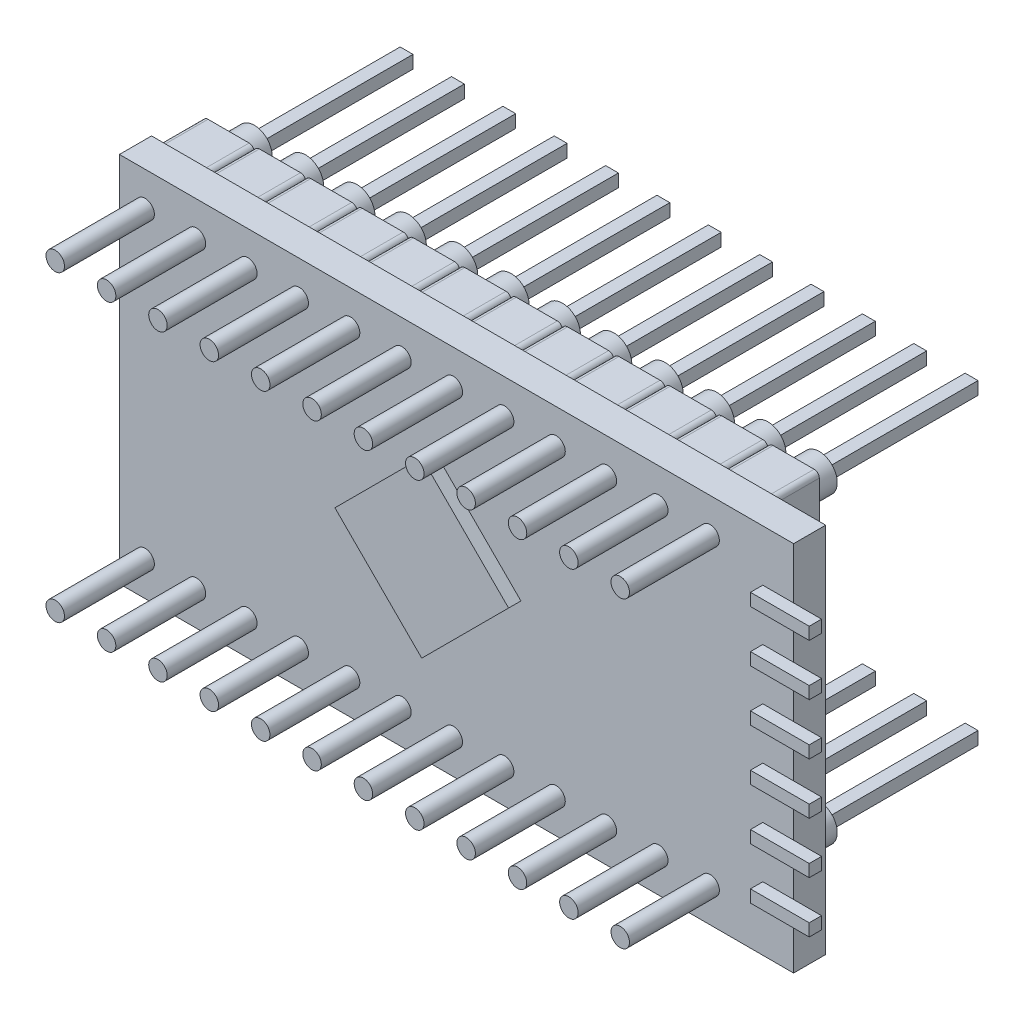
from build123d import *

# Parameters (mm, degrees)
SKETCH1_W           = 33.3375
SKETCH1_H           = 18.3896
BOSS_EXTRUDE1_DEPTH = 1.5875
SKETCH2_R           = 0.4572
BOSS_EXTRUDE2_DEPTH = 4.445
SKETCH3_W           = 2.54
SKETCH3_H           = 2.54
BOSS_EXTRUDE3_DEPTH = 2.54
SKETCH4_R           = 0.889
BOSS_EXTRUDE4_DEPTH = 1.27
SKETCH5_W           = 0.635
SKETCH5_H           = 0.635
BOSS_EXTRUDE5_DEPTH = 7.5311
FILLET3_R           = 0.254
LPATTERN9_COUNT     = 12
LPATTERN9_PITCH     = 2.54
SKETCH6_W           = 10.16
SKETCH6_H           = 0.6096
BOSS_EXTRUDE6_DEPTH = 0.6096
LPATTERN10_COUNT    = 6
LPATTERN10_PITCH    = 2.54
BOSS_EXTRUDE7_DEPTH = 0.6096
SKETCH8_W           = 8.150383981
SKETCH8_H           = 18.236018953
CUT_EXTRUDE1_DEPTH  = 2.54


with BuildPart() as part:
    # Sketch1 → Boss-Extrude1 (new body)
    with BuildSketch(Plane.XY):
        with Locations((16.66875, 0)):
            Rectangle(SKETCH1_W, SKETCH1_H)
    extrude(amount=BOSS_EXTRUDE1_DEPTH)

    # Sketch6 → Boss-Extrude6 (add)
    with BuildSketch(Plane.XY.offset(1.5875)):
        with Locations((36.8935, 6.35)):
            Rectangle(SKETCH6_W, SKETCH6_H)
    boss_extrude6 = extrude(amount=BOSS_EXTRUDE6_DEPTH)

    # LPattern10: Boss-Extrude6 ×6
    with Locations(*[(0, -i * LPATTERN10_PITCH, 0) for i in range(1, LPATTERN10_COUNT)]):
        add(boss_extrude6)

    # Sketch7 → Boss-Extrude7 (add)
    with BuildSketch(Plane.XY.offset(1.5875)):
        Polygon((19.85292697, 0), (15.559269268, 4.293657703), (11.265611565, 0), (15.559269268, -4.293657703), align=None)
    extrude(amount=BOSS_EXTRUDE7_DEPTH)

    # Sketch8 → Cut-Extrude1 (cut)
    with BuildSketch(Plane.XY.offset(2.1971)):
        with Locations((38.794780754, -0.316339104)):
            Rectangle(SKETCH8_W, SKETCH8_H)
    extrude(amount=-CUT_EXTRUDE1_DEPTH, mode=Mode.SUBTRACT)


with BuildPart() as body_2:
    # Sketch2 → Boss-Extrude2 (new body)
    with BuildSketch(Plane.XY.offset(1.5875)):
        with Locations((1.27, -7.493)):
            Circle(SKETCH2_R)
    extrude(amount=BOSS_EXTRUDE2_DEPTH)


with BuildPart() as body_3:
    # Sketch3 → Boss-Extrude3 (new body)
    with BuildSketch(Plane(origin=(0, 0, 0), x_dir=(-1, 0, 0), z_dir=(0, 0, -1))):
        with Locations((-1.27, -7.493)):
            Rectangle(SKETCH3_W, SKETCH3_H)
    extrude(amount=BOSS_EXTRUDE3_DEPTH)

    # Sketch4 → Boss-Extrude4 (add)
    with BuildSketch(Plane(origin=(0, 0, -2.54), x_dir=(-1, 0, 0), z_dir=(0, 0, -1))):
        with Locations((-1.27, -7.493)):
            Circle(SKETCH4_R)
    extrude(amount=BOSS_EXTRUDE4_DEPTH)

    # Sketch5 → Boss-Extrude5 (add)
    with BuildSketch(Plane(origin=(0, 0, -3.81), x_dir=(-1, 0, 0), z_dir=(0, 0, -1))):
        with Locations((-1.27, -7.493)):
            Rectangle(SKETCH5_W, SKETCH5_H)
    extrude(amount=BOSS_EXTRUDE5_DEPTH)

    # Fillet3
    fillet3_edges = [body_3.edges().sort_by_distance(p)[0] for p in [
        (0, -8.763, -1.27),
        (2.54, -8.763, -1.27),
        (2.54, -6.223, -1.27),
        (0, -6.223, -1.27),
    ]]
    fillet(fillet3_edges, radius=FILLET3_R)


with BuildPart() as lpattern9_1:
    # LPattern9: pattern copy
    add(body_3.part.moved(Location(Vector(1, 0, 0) * (1 * LPATTERN9_PITCH))))


with BuildPart() as lpattern9_2:
    # LPattern9: pattern copy
    add(body_3.part.moved(Location(Vector(1, 0, 0) * (2 * LPATTERN9_PITCH))))


with BuildPart() as lpattern9_3:
    # LPattern9: pattern copy
    add(body_3.part.moved(Location(Vector(1, 0, 0) * (3 * LPATTERN9_PITCH))))


with BuildPart() as lpattern9_4:
    # LPattern9: pattern copy
    add(body_3.part.moved(Location(Vector(1, 0, 0) * (4 * LPATTERN9_PITCH))))


with BuildPart() as lpattern9_5:
    # LPattern9: pattern copy
    add(body_3.part.moved(Location(Vector(1, 0, 0) * (5 * LPATTERN9_PITCH))))


with BuildPart() as lpattern9_6:
    # LPattern9: pattern copy
    add(body_3.part.moved(Location(Vector(1, 0, 0) * (6 * LPATTERN9_PITCH))))


with BuildPart() as lpattern9_7:
    # LPattern9: pattern copy
    add(body_3.part.moved(Location(Vector(1, 0, 0) * (7 * LPATTERN9_PITCH))))


with BuildPart() as lpattern9_8:
    # LPattern9: pattern copy
    add(body_3.part.moved(Location(Vector(1, 0, 0) * (8 * LPATTERN9_PITCH))))


with BuildPart() as lpattern9_9:
    # LPattern9: pattern copy
    add(body_3.part.moved(Location(Vector(1, 0, 0) * (9 * LPATTERN9_PITCH))))


with BuildPart() as lpattern9_10:
    # LPattern9: pattern copy
    add(body_3.part.moved(Location(Vector(1, 0, 0) * (10 * LPATTERN9_PITCH))))


with BuildPart() as lpattern9_11:
    # LPattern9: pattern copy
    add(body_3.part.moved(Location(Vector(1, 0, 0) * (11 * LPATTERN9_PITCH))))


with BuildPart() as lpattern9_12:
    # LPattern9: pattern copy
    add(body_2.part.moved(Location(Vector(1, 0, 0) * (1 * LPATTERN9_PITCH))))


with BuildPart() as lpattern9_13:
    # LPattern9: pattern copy
    add(body_2.part.moved(Location(Vector(1, 0, 0) * (2 * LPATTERN9_PITCH))))


with BuildPart() as lpattern9_14:
    # LPattern9: pattern copy
    add(body_2.part.moved(Location(Vector(1, 0, 0) * (3 * LPATTERN9_PITCH))))


with BuildPart() as lpattern9_15:
    # LPattern9: pattern copy
    add(body_2.part.moved(Location(Vector(1, 0, 0) * (4 * LPATTERN9_PITCH))))


with BuildPart() as lpattern9_16:
    # LPattern9: pattern copy
    add(body_2.part.moved(Location(Vector(1, 0, 0) * (5 * LPATTERN9_PITCH))))


with BuildPart() as lpattern9_17:
    # LPattern9: pattern copy
    add(body_2.part.moved(Location(Vector(1, 0, 0) * (6 * LPATTERN9_PITCH))))


with BuildPart() as lpattern9_18:
    # LPattern9: pattern copy
    add(body_2.part.moved(Location(Vector(1, 0, 0) * (7 * LPATTERN9_PITCH))))


with BuildPart() as lpattern9_19:
    # LPattern9: pattern copy
    add(body_2.part.moved(Location(Vector(1, 0, 0) * (8 * LPATTERN9_PITCH))))


with BuildPart() as lpattern9_20:
    # LPattern9: pattern copy
    add(body_2.part.moved(Location(Vector(1, 0, 0) * (9 * LPATTERN9_PITCH))))


with BuildPart() as lpattern9_21:
    # LPattern9: pattern copy
    add(body_2.part.moved(Location(Vector(1, 0, 0) * (10 * LPATTERN9_PITCH))))


with BuildPart() as lpattern9_22:
    # LPattern9: pattern copy
    add(body_2.part.moved(Location(Vector(1, 0, 0) * (11 * LPATTERN9_PITCH))))


with BuildPart() as body_26:
    # Mirror2: mirrored copy
    add(body_2.part.mirror(Plane.ZX))


with BuildPart() as body_27:
    # Mirror2 2: mirrored copy
    add(body_3.part.mirror(Plane.ZX))


with BuildPart() as body_28:
    # Mirror2 3: mirrored copy
    add(lpattern9_1.part.mirror(Plane.ZX))


with BuildPart() as body_29:
    # Mirror2 4: mirrored copy
    add(lpattern9_2.part.mirror(Plane.ZX))


with BuildPart() as body_30:
    # Mirror2 5: mirrored copy
    add(lpattern9_3.part.mirror(Plane.ZX))


with BuildPart() as body_31:
    # Mirror2 6: mirrored copy
    add(lpattern9_4.part.mirror(Plane.ZX))


with BuildPart() as body_32:
    # Mirror2 7: mirrored copy
    add(lpattern9_5.part.mirror(Plane.ZX))


with BuildPart() as body_33:
    # Mirror2 8: mirrored copy
    add(lpattern9_6.part.mirror(Plane.ZX))


with BuildPart() as body_34:
    # Mirror2 9: mirrored copy
    add(lpattern9_7.part.mirror(Plane.ZX))


with BuildPart() as body_35:
    # Mirror2 10: mirrored copy
    add(lpattern9_8.part.mirror(Plane.ZX))


with BuildPart() as body_36:
    # Mirror2 11: mirrored copy
    add(lpattern9_9.part.mirror(Plane.ZX))


with BuildPart() as body_37:
    # Mirror2 12: mirrored copy
    add(lpattern9_10.part.mirror(Plane.ZX))


with BuildPart() as body_38:
    # Mirror2 13: mirrored copy
    add(lpattern9_11.part.mirror(Plane.ZX))


with BuildPart() as body_39:
    # Mirror2 14: mirrored copy
    add(lpattern9_12.part.mirror(Plane.ZX))


with BuildPart() as body_40:
    # Mirror2 15: mirrored copy
    add(lpattern9_13.part.mirror(Plane.ZX))


with BuildPart() as body_41:
    # Mirror2 16: mirrored copy
    add(lpattern9_14.part.mirror(Plane.ZX))


with BuildPart() as body_42:
    # Mirror2 17: mirrored copy
    add(lpattern9_15.part.mirror(Plane.ZX))


with BuildPart() as body_43:
    # Mirror2 18: mirrored copy
    add(lpattern9_16.part.mirror(Plane.ZX))


with BuildPart() as body_44:
    # Mirror2 19: mirrored copy
    add(lpattern9_17.part.mirror(Plane.ZX))


with BuildPart() as body_45:
    # Mirror2 20: mirrored copy
    add(lpattern9_18.part.mirror(Plane.ZX))


with BuildPart() as body_46:
    # Mirror2 21: mirrored copy
    add(lpattern9_19.part.mirror(Plane.ZX))


with BuildPart() as body_47:
    # Mirror2 22: mirrored copy
    add(lpattern9_20.part.mirror(Plane.ZX))


with BuildPart() as body_48:
    # Mirror2 23: mirrored copy
    add(lpattern9_21.part.mirror(Plane.ZX))


with BuildPart() as body_49:
    # Mirror2 24: mirrored copy
    add(lpattern9_22.part.mirror(Plane.ZX))


solid = Compound([part.part, body_2.part, body_3.part, lpattern9_1.part, lpattern9_2.part, lpattern9_3.part, lpattern9_4.part, lpattern9_5.part, lpattern9_6.part, lpattern9_7.part, lpattern9_8.part, lpattern9_9.part, lpattern9_10.part, lpattern9_11.part, lpattern9_12.part, lpattern9_13.part, lpattern9_14.part, lpattern9_15.part, lpattern9_16.part, lpattern9_17.part, lpattern9_18.part, lpattern9_19.part, lpattern9_20.part, lpattern9_21.part, lpattern9_22.part, body_26.part, body_27.part, body_28.part, body_29.part, body_30.part, body_31.part, body_32.part, body_33.part, body_34.part, body_35.part, body_36.part, body_37.part, body_38.part, body_39.part, body_40.part, body_41.part, body_42.part, body_43.part, body_44.part, body_45.part, body_46.part, body_47.part, body_48.part, body_49.part])
